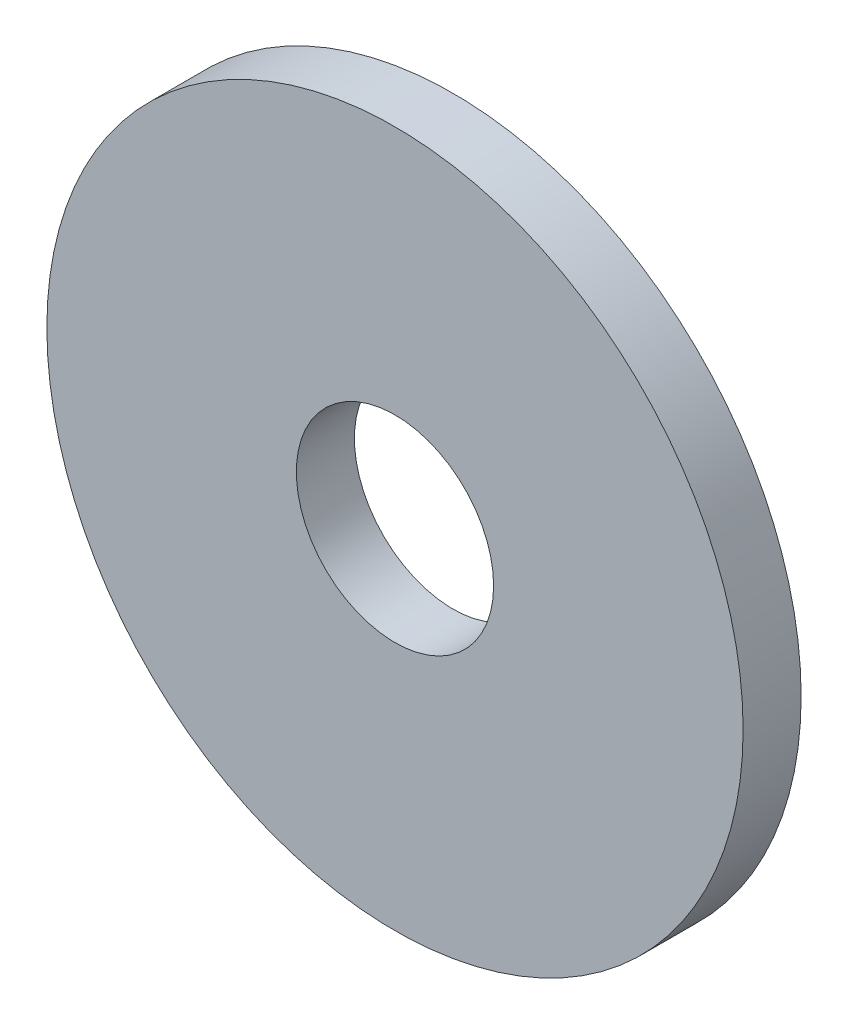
ISO-10303-21;
HEADER;
FILE_DESCRIPTION(('STEP AP214'),'2;1');
FILE_NAME('part.step','',(''),(''),'','','');
FILE_SCHEMA(('AUTOMOTIVE_DESIGN { 1 0 10303 214 1 1 1 1 }'));
ENDSEC;
DATA;
#1=APPLICATION_CONTEXT('core data for automotive mechanical design processes');
#2=APPLICATION_PROTOCOL_DEFINITION('international standard','automotive_design',2000,#1);
#3=PRODUCT_CONTEXT('',#1,'mechanical');
#4=PRODUCT('Part','Part','',(#3));
#5=PRODUCT_RELATED_PRODUCT_CATEGORY('part','',(#4));
#6=PRODUCT_DEFINITION_FORMATION('','',#4);
#7=PRODUCT_DEFINITION_CONTEXT('part definition',#1,'design');
#8=PRODUCT_DEFINITION('design','',#6,#7);
#9=PRODUCT_DEFINITION_SHAPE('','',#8);
#10=(LENGTH_UNIT() NAMED_UNIT(*) SI_UNIT(.MILLI.,.METRE.));
#11=(NAMED_UNIT(*) PLANE_ANGLE_UNIT() SI_UNIT($,.RADIAN.));
#12=(NAMED_UNIT(*) SI_UNIT($,.STERADIAN.) SOLID_ANGLE_UNIT());
#13=UNCERTAINTY_MEASURE_WITH_UNIT(LENGTH_MEASURE(1.E-05),#10,'distance_accuracy_value','');
#14=(GEOMETRIC_REPRESENTATION_CONTEXT(3) GLOBAL_UNCERTAINTY_ASSIGNED_CONTEXT((#13)) GLOBAL_UNIT_ASSIGNED_CONTEXT((#10,
#11,#12)) REPRESENTATION_CONTEXT('',''));
#15=CARTESIAN_POINT('',(0.,0.,0.));
#16=DIRECTION('',(0.,0.,1.));
#17=DIRECTION('',(1.,0.,0.));
#18=AXIS2_PLACEMENT_3D('',#15,#16,#17);
#19=CARTESIAN_POINT('',(0.,0.,5.));
#20=DIRECTION('',(0.,0.,1.));
#21=DIRECTION('',(1.,0.,0.));
#22=AXIS2_PLACEMENT_3D('',#19,#20,#21);
#23=PLANE('',#22);
#24=CARTESIAN_POINT('',(0.,0.,5.));
#25=DIRECTION('',(0.,0.,1.));
#26=DIRECTION('',(1.,0.,0.));
#27=AXIS2_PLACEMENT_3D('',#24,#25,#26);
#28=CIRCLE('',#27,30.);
#29=CARTESIAN_POINT('',(30.,0.,5.));
#30=VERTEX_POINT('',#29);
#31=EDGE_CURVE('E8',#30,#30,#28,.T.);
#32=ORIENTED_EDGE('',*,*,#31,.T.);
#33=EDGE_LOOP('',(#32));
#34=FACE_BOUND('',#33,.T.);
#35=CARTESIAN_POINT('',(0.,0.,5.));
#36=DIRECTION('',(0.,0.,1.));
#37=DIRECTION('',(1.,0.,0.));
#38=AXIS2_PLACEMENT_3D('',#35,#36,#37);
#39=CIRCLE('',#38,8.5);
#40=CARTESIAN_POINT('',(8.5,0.,5.));
#41=VERTEX_POINT('',#40);
#42=EDGE_CURVE('E23',#41,#41,#39,.T.);
#43=ORIENTED_EDGE('',*,*,#42,.F.);
#44=EDGE_LOOP('',(#43));
#45=FACE_BOUND('',#44,.T.);
#46=ADVANCED_FACE('F12',(#34,#45),#23,.T.);
#47=CARTESIAN_POINT('',(0.,0.,0.));
#48=DIRECTION('',(0.,0.,1.));
#49=DIRECTION('',(1.,0.,0.));
#50=AXIS2_PLACEMENT_3D('',#47,#48,#49);
#51=PLANE('',#50);
#52=CARTESIAN_POINT('',(0.,0.,0.));
#53=DIRECTION('',(0.,0.,1.));
#54=DIRECTION('',(1.,0.,0.));
#55=AXIS2_PLACEMENT_3D('',#52,#53,#54);
#56=CIRCLE('',#55,30.);
#57=CARTESIAN_POINT('',(30.,0.,0.));
#58=VERTEX_POINT('',#57);
#59=EDGE_CURVE('E19',#58,#58,#56,.T.);
#60=ORIENTED_EDGE('',*,*,#59,.F.);
#61=EDGE_LOOP('',(#60));
#62=FACE_BOUND('',#61,.T.);
#63=CARTESIAN_POINT('',(0.,0.,0.));
#64=DIRECTION('',(0.,0.,1.));
#65=DIRECTION('',(1.,0.,0.));
#66=AXIS2_PLACEMENT_3D('',#63,#64,#65);
#67=CIRCLE('',#66,8.5);
#68=CARTESIAN_POINT('',(8.5,0.,0.));
#69=VERTEX_POINT('',#68);
#70=EDGE_CURVE('E27',#69,#69,#67,.T.);
#71=ORIENTED_EDGE('',*,*,#70,.T.);
#72=EDGE_LOOP('',(#71));
#73=FACE_BOUND('',#72,.T.);
#74=ADVANCED_FACE('F33',(#62,#73),#51,.F.);
#75=CARTESIAN_POINT('',(0.,0.,5.));
#76=DIRECTION('',(0.,0.,-1.));
#77=DIRECTION('',(-1.,0.,0.));
#78=AXIS2_PLACEMENT_3D('',#75,#76,#77);
#79=CYLINDRICAL_SURFACE('',#78,30.);
#80=ORIENTED_EDGE('',*,*,#31,.F.);
#81=EDGE_LOOP('',(#80));
#82=FACE_BOUND('',#81,.T.);
#83=ORIENTED_EDGE('',*,*,#59,.T.);
#84=EDGE_LOOP('',(#83));
#85=FACE_BOUND('',#84,.T.);
#86=ADVANCED_FACE('F14',(#82,#85),#79,.T.);
#87=CARTESIAN_POINT('',(0.,0.,5.));
#88=DIRECTION('',(0.,0.,-1.));
#89=DIRECTION('',(-1.,0.,0.));
#90=AXIS2_PLACEMENT_3D('',#87,#88,#89);
#91=CYLINDRICAL_SURFACE('',#90,8.5);
#92=ORIENTED_EDGE('',*,*,#42,.T.);
#93=EDGE_LOOP('',(#92));
#94=FACE_BOUND('',#93,.T.);
#95=ORIENTED_EDGE('',*,*,#70,.F.);
#96=EDGE_LOOP('',(#95));
#97=FACE_BOUND('',#96,.T.);
#98=ADVANCED_FACE('F35',(#94,#97),#91,.F.);
#99=CLOSED_SHELL('',(#46,#74,#86,#98));
#100=MANIFOLD_SOLID_BREP('B1',#99);
#101=ADVANCED_BREP_SHAPE_REPRESENTATION('',(#18,#100),#14);
#102=SHAPE_DEFINITION_REPRESENTATION(#9,#101);
ENDSEC;
END-ISO-10303-21;
